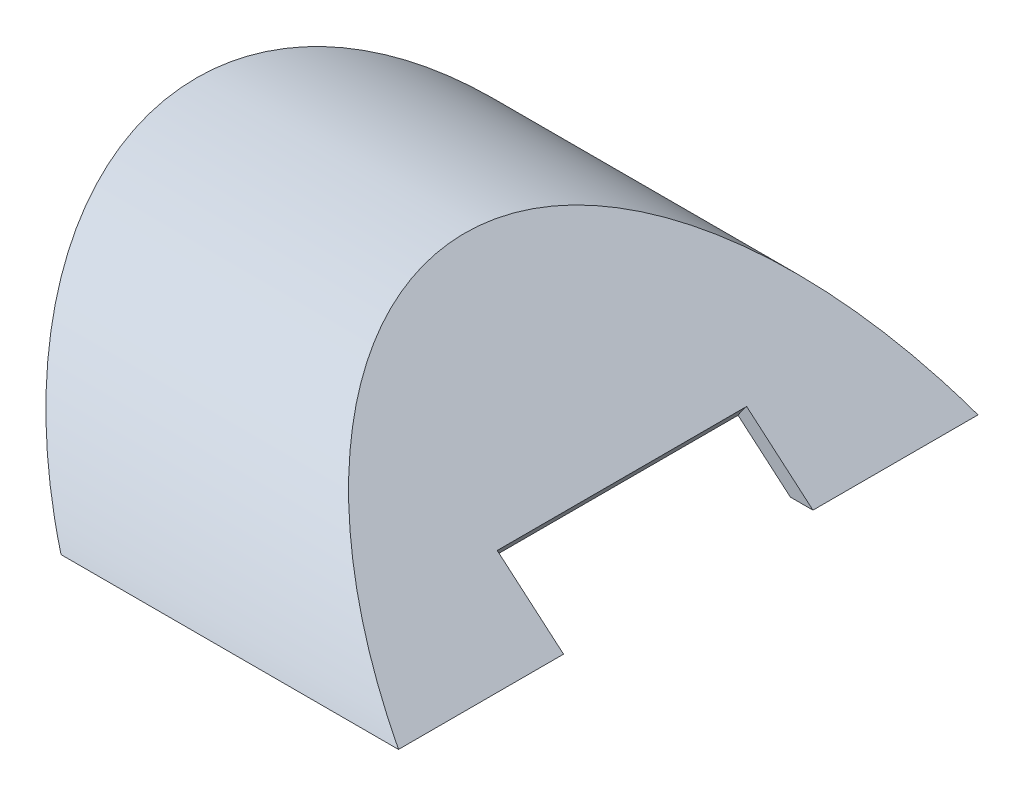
ISO-10303-21;
HEADER;
FILE_DESCRIPTION(('STEP AP214'),'2;1');
FILE_NAME('part.step','',(''),(''),'','','');
FILE_SCHEMA(('AUTOMOTIVE_DESIGN { 1 0 10303 214 1 1 1 1 }'));
ENDSEC;
DATA;
#1=APPLICATION_CONTEXT('core data for automotive mechanical design processes');
#2=APPLICATION_PROTOCOL_DEFINITION('international standard','automotive_design',2000,#1);
#3=PRODUCT_CONTEXT('',#1,'mechanical');
#4=PRODUCT('Part','Part','',(#3));
#5=PRODUCT_RELATED_PRODUCT_CATEGORY('part','',(#4));
#6=PRODUCT_DEFINITION_FORMATION('','',#4);
#7=PRODUCT_DEFINITION_CONTEXT('part definition',#1,'design');
#8=PRODUCT_DEFINITION('design','',#6,#7);
#9=PRODUCT_DEFINITION_SHAPE('','',#8);
#10=(LENGTH_UNIT() NAMED_UNIT(*) SI_UNIT(.MILLI.,.METRE.));
#11=(NAMED_UNIT(*) PLANE_ANGLE_UNIT() SI_UNIT($,.RADIAN.));
#12=(NAMED_UNIT(*) SI_UNIT($,.STERADIAN.) SOLID_ANGLE_UNIT());
#13=UNCERTAINTY_MEASURE_WITH_UNIT(LENGTH_MEASURE(1.E-05),#10,'distance_accuracy_value','');
#14=(GEOMETRIC_REPRESENTATION_CONTEXT(3) GLOBAL_UNCERTAINTY_ASSIGNED_CONTEXT((#13)) GLOBAL_UNIT_ASSIGNED_CONTEXT((#10,
#11,#12)) REPRESENTATION_CONTEXT('',''));
#15=CARTESIAN_POINT('',(0.,0.,0.));
#16=DIRECTION('',(0.,0.,1.));
#17=DIRECTION('',(1.,0.,0.));
#18=AXIS2_PLACEMENT_3D('',#15,#16,#17);
#19=CARTESIAN_POINT('',(0.,8.5,30.));
#20=DIRECTION('',(0.,1.,0.));
#21=DIRECTION('',(0.,0.,1.));
#22=AXIS2_PLACEMENT_3D('',#19,#20,#21);
#23=PLANE('',#22);
#24=DIRECTION('',(1.,0.,0.));
#25=VECTOR('',#24,1.);
#26=CARTESIAN_POINT('',(0.,8.5,-8.5));
#27=LINE('',#26,#25);
#28=CARTESIAN_POINT('',(21.4602309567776,8.5,-8.5));
#29=VERTEX_POINT('',#28);
#30=CARTESIAN_POINT('',(23.,8.5,-8.5));
#31=VERTEX_POINT('',#30);
#32=EDGE_CURVE('E128',#29,#31,#27,.T.);
#33=ORIENTED_EDGE('',*,*,#32,.F.);
#34=DIRECTION('',(0.,0.,-1.));
#35=VECTOR('',#34,1.);
#36=CARTESIAN_POINT('',(21.4602309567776,8.5,30.));
#37=LINE('',#36,#35);
#38=CARTESIAN_POINT('',(21.4602309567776,8.5,-18.6547581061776));
#39=VERTEX_POINT('',#38);
#40=EDGE_CURVE('E55',#29,#39,#37,.T.);
#41=ORIENTED_EDGE('',*,*,#40,.T.);
#42=DIRECTION('',(1.,0.,0.));
#43=VECTOR('',#42,1.);
#44=CARTESIAN_POINT('',(21.4602309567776,8.5,-18.6547581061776));
#45=LINE('',#44,#43);
#46=CARTESIAN_POINT('',(1.28675956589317,8.5,-18.6547581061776));
#47=VERTEX_POINT('',#46);
#48=EDGE_CURVE('E161',#39,#47,#45,.F.);
#49=ORIENTED_EDGE('',*,*,#48,.T.);
#50=CARTESIAN_POINT('',(1.28675956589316,8.5,-18.6547581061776));
#51=CARTESIAN_POINT('',(1.07181614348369,8.5,-18.6068714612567));
#52=CARTESIAN_POINT('',(0.857114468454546,8.5,-18.5579471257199));
#53=CARTESIAN_POINT('',(0.428194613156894,8.5,-18.4580230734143));
#54=CARTESIAN_POINT('',(0.213976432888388,8.5,-18.4070233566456));
#55=CARTESIAN_POINT('',(2.02095284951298E-13,8.5,-18.3549859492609));
#56=B_SPLINE_CURVE_WITH_KNOTS('',3,(#50,#51,#52,#53,#54,#55),.UNSPECIFIED.,.F.,.F.,(4,2,4),(0.,
0.660616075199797,1.32123215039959),.UNSPECIFIED.);
#57=CARTESIAN_POINT('',(0.,8.5,-18.3549859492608));
#58=VERTEX_POINT('',#57);
#59=EDGE_CURVE('E150',#47,#58,#56,.T.);
#60=ORIENTED_EDGE('',*,*,#59,.T.);
#61=DIRECTION('',(0.,0.,-1.));
#62=VECTOR('',#61,1.);
#63=CARTESIAN_POINT('',(0.,8.5,30.));
#64=LINE('',#63,#62);
#65=CARTESIAN_POINT('',(0.,8.5,-19.7484176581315));
#66=VERTEX_POINT('',#65);
#67=EDGE_CURVE('E182',#58,#66,#64,.T.);
#68=ORIENTED_EDGE('',*,*,#67,.T.);
#69=DIRECTION('',(1.,0.,0.));
#70=VECTOR('',#69,1.);
#71=CARTESIAN_POINT('',(-30.,8.5,-19.7484176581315));
#72=LINE('',#71,#70);
#73=CARTESIAN_POINT('',(23.,8.5,-19.7484176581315));
#74=VERTEX_POINT('',#73);
#75=EDGE_CURVE('E168',#74,#66,#72,.F.);
#76=ORIENTED_EDGE('',*,*,#75,.F.);
#77=DIRECTION('',(0.,0.,-1.));
#78=VECTOR('',#77,1.);
#79=CARTESIAN_POINT('',(23.,8.5,30.));
#80=LINE('',#79,#78);
#81=EDGE_CURVE('E186',#31,#74,#80,.T.);
#82=ORIENTED_EDGE('',*,*,#81,.F.);
#83=EDGE_LOOP('',(#33,#41,#49,#60,#68,#76,#82));
#84=FACE_BOUND('',#83,.T.);
#85=ADVANCED_FACE('F31',(#84),#23,.F.);
#86=CARTESIAN_POINT('',(23.,8.5,30.));
#87=DIRECTION('',(-0.649448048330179,-0.760405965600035,0.));
#88=DIRECTION('',(0.760405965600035,-0.649448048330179,0.));
#89=AXIS2_PLACEMENT_3D('',#86,#87,#88);
#90=PLANE('',#89);
#91=DIRECTION('',(-0.760405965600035,0.649448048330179,0.));
#92=VECTOR('',#91,1.);
#93=CARTESIAN_POINT('',(23.,8.5,-8.5));
#94=LINE('',#93,#92);
#95=CARTESIAN_POINT('',(18.4792767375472,12.3610624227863,-8.5));
#96=VERTEX_POINT('',#95);
#97=EDGE_CURVE('E117',#31,#96,#94,.T.);
#98=ORIENTED_EDGE('',*,*,#97,.F.);
#99=ORIENTED_EDGE('',*,*,#81,.T.);
#100=CARTESIAN_POINT('',(32.9522213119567,0.,0.));
#101=DIRECTION('',(-0.649448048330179,-0.760405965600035,0.));
#102=DIRECTION('',(0.760405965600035,-0.649448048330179,0.));
#103=AXIS2_PLACEMENT_3D('',#100,#101,#102);
#104=ELLIPSE('',#103,33.1050344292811,21.5);
#105=CARTESIAN_POINT('',(23.,8.5,19.7484176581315));
#106=VERTEX_POINT('',#105);
#107=EDGE_CURVE('E179',#106,#74,#104,.T.);
#108=ORIENTED_EDGE('',*,*,#107,.F.);
#109=CARTESIAN_POINT('',(23.,8.5,8.5));
#110=VERTEX_POINT('',#109);
#111=EDGE_CURVE('E127',#106,#110,#80,.T.);
#112=ORIENTED_EDGE('',*,*,#111,.T.);
#113=DIRECTION('',(-0.760405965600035,0.649448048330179,0.));
#114=VECTOR('',#113,1.);
#115=CARTESIAN_POINT('',(23.,8.5,8.5));
#116=LINE('',#115,#114);
#117=CARTESIAN_POINT('',(18.4792767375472,12.3610624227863,8.5));
#118=VERTEX_POINT('',#117);
#119=EDGE_CURVE('E120',#110,#118,#116,.T.);
#120=ORIENTED_EDGE('',*,*,#119,.T.);
#121=DIRECTION('',(0.,0.,1.));
#122=VECTOR('',#121,1.);
#123=CARTESIAN_POINT('',(18.4792767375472,12.3610624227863,-8.5));
#124=LINE('',#123,#122);
#125=EDGE_CURVE('E106',#118,#96,#124,.F.);
#126=ORIENTED_EDGE('',*,*,#125,.T.);
#127=EDGE_LOOP('',(#98,#99,#108,#112,#120,#126));
#128=FACE_BOUND('',#127,.T.);
#129=ADVANCED_FACE('F124',(#128),#90,.F.);
#130=CARTESIAN_POINT('',(22.3505519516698,7.73959403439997,30.));
#131=DIRECTION('',(-0.649448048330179,-0.760405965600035,0.));
#132=DIRECTION('',(0.760405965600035,-0.649448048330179,0.));
#133=AXIS2_PLACEMENT_3D('',#130,#131,#132);
#134=PLANE('',#133);
#135=ORIENTED_EDGE('',*,*,#40,.F.);
#136=DIRECTION('',(-0.760405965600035,0.649448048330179,0.));
#137=VECTOR('',#136,1.);
#138=CARTESIAN_POINT('',(22.3505519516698,7.73959403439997,-8.5));
#139=LINE('',#138,#137);
#140=CARTESIAN_POINT('',(17.8942393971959,11.5456445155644,-8.5));
#141=VERTEX_POINT('',#140);
#142=EDGE_CURVE('E12',#29,#141,#139,.T.);
#143=ORIENTED_EDGE('',*,*,#142,.T.);
#144=DIRECTION('',(0.,0.,1.));
#145=VECTOR('',#144,1.);
#146=CARTESIAN_POINT('',(17.8942393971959,11.5456445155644,-8.5));
#147=LINE('',#146,#145);
#148=CARTESIAN_POINT('',(17.8942393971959,11.5456445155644,8.5));
#149=VERTEX_POINT('',#148);
#150=EDGE_CURVE('E40',#149,#141,#147,.F.);
#151=ORIENTED_EDGE('',*,*,#150,.F.);
#152=DIRECTION('',(-0.760405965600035,0.649448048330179,0.));
#153=VECTOR('',#152,1.);
#154=CARTESIAN_POINT('',(22.3505519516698,7.73959403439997,8.5));
#155=LINE('',#154,#153);
#156=CARTESIAN_POINT('',(21.4602309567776,8.5,8.5));
#157=VERTEX_POINT('',#156);
#158=EDGE_CURVE('E121',#157,#149,#155,.T.);
#159=ORIENTED_EDGE('',*,*,#158,.F.);
#160=CARTESIAN_POINT('',(21.4602309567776,8.5,18.6547581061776));
#161=VERTEX_POINT('',#160);
#162=EDGE_CURVE('E169',#161,#157,#37,.T.);
#163=ORIENTED_EDGE('',*,*,#162,.F.);
#164=CARTESIAN_POINT('',(31.4124522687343,0.,0.));
#165=DIRECTION('',(-0.649448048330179,-0.760405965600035,0.));
#166=DIRECTION('',(0.760405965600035,-0.649448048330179,0.));
#167=AXIS2_PLACEMENT_3D('',#164,#165,#166);
#168=ELLIPSE('',#167,31.5652653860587,20.5);
#169=EDGE_CURVE('E162',#161,#39,#168,.T.);
#170=ORIENTED_EDGE('',*,*,#169,.T.);
#171=EDGE_LOOP('',(#135,#143,#151,#159,#163,#170));
#172=FACE_BOUND('',#171,.T.);
#173=ADVANCED_FACE('F147',(#172),#134,.T.);
#174=ORIENTED_EDGE('',*,*,#162,.T.);
#175=DIRECTION('',(1.,0.,0.));
#176=VECTOR('',#175,1.);
#177=CARTESIAN_POINT('',(0.,8.5,8.5));
#178=LINE('',#177,#176);
#179=EDGE_CURVE('E47',#157,#110,#178,.T.);
#180=ORIENTED_EDGE('',*,*,#179,.T.);
#181=ORIENTED_EDGE('',*,*,#111,.F.);
#182=DIRECTION('',(1.,0.,0.));
#183=VECTOR('',#182,1.);
#184=CARTESIAN_POINT('',(-30.,8.5,19.7484176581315));
#185=LINE('',#184,#183);
#186=CARTESIAN_POINT('',(0.,8.5,19.7484176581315));
#187=VERTEX_POINT('',#186);
#188=EDGE_CURVE('E177',#187,#106,#185,.T.);
#189=ORIENTED_EDGE('',*,*,#188,.F.);
#190=CARTESIAN_POINT('',(0.,8.5,18.3549859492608));
#191=VERTEX_POINT('',#190);
#192=EDGE_CURVE('E183',#187,#191,#64,.T.);
#193=ORIENTED_EDGE('',*,*,#192,.T.);
#194=CARTESIAN_POINT('',(0.,8.49999999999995,18.3549859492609));
#195=CARTESIAN_POINT('',(0.213976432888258,8.49999999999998,18.4070233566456));
#196=CARTESIAN_POINT('',(0.428194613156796,8.49999999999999,18.4580230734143));
#197=CARTESIAN_POINT('',(0.857114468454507,8.50000000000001,18.5579471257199));
#198=CARTESIAN_POINT('',(1.07181614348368,8.50000000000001,18.6068714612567));
#199=CARTESIAN_POINT('',(1.28675956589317,8.5,18.6547581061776));
#200=B_SPLINE_CURVE_WITH_KNOTS('',3,(#194,#195,#196,#197,#198,#199),.UNSPECIFIED.,.F.,.F.,(4,2,
4),(0.,0.66061607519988,1.32123215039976),.UNSPECIFIED.);
#201=CARTESIAN_POINT('',(1.28675956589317,8.5,18.6547581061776));
#202=VERTEX_POINT('',#201);
#203=EDGE_CURVE('E155',#191,#202,#200,.T.);
#204=ORIENTED_EDGE('',*,*,#203,.T.);
#205=DIRECTION('',(1.,0.,0.));
#206=VECTOR('',#205,1.);
#207=CARTESIAN_POINT('',(1.28675956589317,8.5,18.6547581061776));
#208=LINE('',#207,#206);
#209=EDGE_CURVE('E165',#202,#161,#208,.T.);
#210=ORIENTED_EDGE('',*,*,#209,.T.);
#211=EDGE_LOOP('',(#174,#180,#181,#189,#193,#204,#210));
#212=FACE_BOUND('',#211,.T.);
#213=ADVANCED_FACE('F33',(#212),#23,.F.);
#214=CARTESIAN_POINT('',(-10.5271924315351,21.5,30.));
#215=DIRECTION('',(0.777145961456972,0.629320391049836,0.));
#216=DIRECTION('',(-0.629320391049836,0.777145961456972,0.));
#217=AXIS2_PLACEMENT_3D('',#214,#215,#216);
#218=PLANE('',#217);
#219=ORIENTED_EDGE('',*,*,#67,.F.);
#220=CARTESIAN_POINT('',(7.39277788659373,-0.629320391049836,0.));
#221=DIRECTION('',(0.777145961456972,0.629320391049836,0.));
#222=DIRECTION('',(0.629320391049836,-0.777145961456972,0.));
#223=AXIS2_PLACEMENT_3D('',#220,#221,#222);
#224=ELLIPSE('',#223,26.3785711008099,20.5);
#225=EDGE_CURVE('E116',#58,#191,#224,.T.);
#226=ORIENTED_EDGE('',*,*,#225,.T.);
#227=ORIENTED_EDGE('',*,*,#192,.F.);
#228=CARTESIAN_POINT('',(6.88316428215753,0.,0.));
#229=DIRECTION('',(0.777145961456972,0.629320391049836,0.));
#230=DIRECTION('',(0.629320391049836,-0.777145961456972,0.));
#231=AXIS2_PLACEMENT_3D('',#228,#229,#230);
#232=ELLIPSE('',#231,27.6653306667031,21.5);
#233=EDGE_CURVE('E188',#66,#187,#232,.T.);
#234=ORIENTED_EDGE('',*,*,#233,.F.);
#235=EDGE_LOOP('',(#219,#226,#227,#234));
#236=FACE_BOUND('',#235,.T.);
#237=ADVANCED_FACE('F203',(#236),#218,.F.);
#238=CARTESIAN_POINT('',(-30.,0.,0.));
#239=DIRECTION('',(1.,0.,0.));
#240=DIRECTION('',(0.,0.,-1.));
#241=AXIS2_PLACEMENT_3D('',#238,#239,#240);
#242=CYLINDRICAL_SURFACE('',#241,21.5);
#243=ORIENTED_EDGE('',*,*,#75,.T.);
#244=ORIENTED_EDGE('',*,*,#233,.T.);
#245=ORIENTED_EDGE('',*,*,#188,.T.);
#246=ORIENTED_EDGE('',*,*,#107,.T.);
#247=EDGE_LOOP('',(#243,#244,#245,#246));
#248=FACE_BOUND('',#247,.T.);
#249=ADVANCED_FACE('F207',(#248),#242,.T.);
#250=CARTESIAN_POINT('',(-30.,0.,0.));
#251=DIRECTION('',(1.,0.,0.));
#252=DIRECTION('',(0.,0.,-1.));
#253=AXIS2_PLACEMENT_3D('',#250,#251,#252);
#254=CYLINDRICAL_SURFACE('',#253,20.5);
#255=ORIENTED_EDGE('',*,*,#48,.F.);
#256=ORIENTED_EDGE('',*,*,#169,.F.);
#257=ORIENTED_EDGE('',*,*,#209,.F.);
#258=CARTESIAN_POINT('',(8.1699238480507,0.,0.));
#259=DIRECTION('',(0.777145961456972,0.629320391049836,0.));
#260=DIRECTION('',(0.629320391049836,-0.777145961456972,0.));
#261=AXIS2_PLACEMENT_3D('',#258,#259,#260);
#262=ELLIPSE('',#261,26.3785711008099,20.5);
#263=EDGE_CURVE('E166',#47,#202,#262,.T.);
#264=ORIENTED_EDGE('',*,*,#263,.F.);
#265=EDGE_LOOP('',(#255,#256,#257,#264));
#266=FACE_BOUND('',#265,.T.);
#267=ADVANCED_FACE('F144',(#266),#254,.F.);
#268=CARTESIAN_POINT('',(1.03481848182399,-5.77789440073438,0.));
#269=DIRECTION('',(0.777145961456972,0.629320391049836,0.));
#270=DIRECTION('',(0.629320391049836,-0.777145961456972,0.));
#271=AXIS2_PLACEMENT_3D('',#268,#269,#270);
#272=ELLIPSE('',#271,26.3785711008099,20.5);
#273=DIRECTION('',(0.777145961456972,0.629320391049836,0.));
#274=VECTOR('',#273,1.);
#275=SURFACE_OF_LINEAR_EXTRUSION('',#272,#274);
#276=ORIENTED_EDGE('',*,*,#225,.F.);
#277=ORIENTED_EDGE('',*,*,#59,.F.);
#278=ORIENTED_EDGE('',*,*,#263,.T.);
#279=ORIENTED_EDGE('',*,*,#203,.F.);
#280=EDGE_LOOP('',(#276,#277,#278,#279));
#281=FACE_BOUND('',#280,.T.);
#282=ADVANCED_FACE('F139',(#281),#275,.F.);
#283=CARTESIAN_POINT('',(23.,8.5,-8.5));
#284=DIRECTION('',(0.,0.,1.));
#285=DIRECTION('',(1.,0.,0.));
#286=AXIS2_PLACEMENT_3D('',#283,#284,#285);
#287=CYLINDRICAL_SURFACE('',#286,5.94514439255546);
#288=CARTESIAN_POINT('',(23.,8.5,8.5));
#289=DIRECTION('',(0.,0.,1.));
#290=DIRECTION('',(1.,0.,0.));
#291=AXIS2_PLACEMENT_3D('',#288,#289,#290);
#292=CIRCLE('',#291,5.94514439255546);
#293=EDGE_CURVE('E109',#118,#149,#292,.T.);
#294=ORIENTED_EDGE('',*,*,#293,.T.);
#295=ORIENTED_EDGE('',*,*,#150,.T.);
#296=CARTESIAN_POINT('',(23.,8.5,-8.5));
#297=DIRECTION('',(0.,0.,1.));
#298=DIRECTION('',(1.,0.,0.));
#299=AXIS2_PLACEMENT_3D('',#296,#297,#298);
#300=CIRCLE('',#299,5.94514439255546);
#301=EDGE_CURVE('E112',#96,#141,#300,.T.);
#302=ORIENTED_EDGE('',*,*,#301,.F.);
#303=ORIENTED_EDGE('',*,*,#125,.F.);
#304=EDGE_LOOP('',(#294,#295,#302,#303));
#305=FACE_BOUND('',#304,.T.);
#306=ADVANCED_FACE('F108',(#305),#287,.F.);
#307=CARTESIAN_POINT('',(23.,8.5,-8.5));
#308=DIRECTION('',(0.,0.,1.));
#309=DIRECTION('',(1.,0.,0.));
#310=AXIS2_PLACEMENT_3D('',#307,#308,#309);
#311=PLANE('',#310);
#312=ORIENTED_EDGE('',*,*,#97,.T.);
#313=ORIENTED_EDGE('',*,*,#301,.T.);
#314=ORIENTED_EDGE('',*,*,#142,.F.);
#315=ORIENTED_EDGE('',*,*,#32,.T.);
#316=EDGE_LOOP('',(#312,#313,#314,#315));
#317=FACE_BOUND('',#316,.T.);
#318=ADVANCED_FACE('F192',(#317),#311,.T.);
#319=CARTESIAN_POINT('',(23.,8.5,8.5));
#320=DIRECTION('',(0.,0.,1.));
#321=DIRECTION('',(1.,0.,0.));
#322=AXIS2_PLACEMENT_3D('',#319,#320,#321);
#323=PLANE('',#322);
#324=ORIENTED_EDGE('',*,*,#179,.F.);
#325=ORIENTED_EDGE('',*,*,#158,.T.);
#326=ORIENTED_EDGE('',*,*,#293,.F.);
#327=ORIENTED_EDGE('',*,*,#119,.F.);
#328=EDGE_LOOP('',(#324,#325,#326,#327));
#329=FACE_BOUND('',#328,.T.);
#330=ADVANCED_FACE('F119',(#329),#323,.F.);
#331=CLOSED_SHELL('',(#85,#129,#173,#213,#237,#249,#267,#282,#306,#318,#330));
#332=MANIFOLD_SOLID_BREP('B2',#331);
#333=ADVANCED_BREP_SHAPE_REPRESENTATION('',(#18,#332),#14);
#334=SHAPE_DEFINITION_REPRESENTATION(#9,#333);
ENDSEC;
END-ISO-10303-21;
